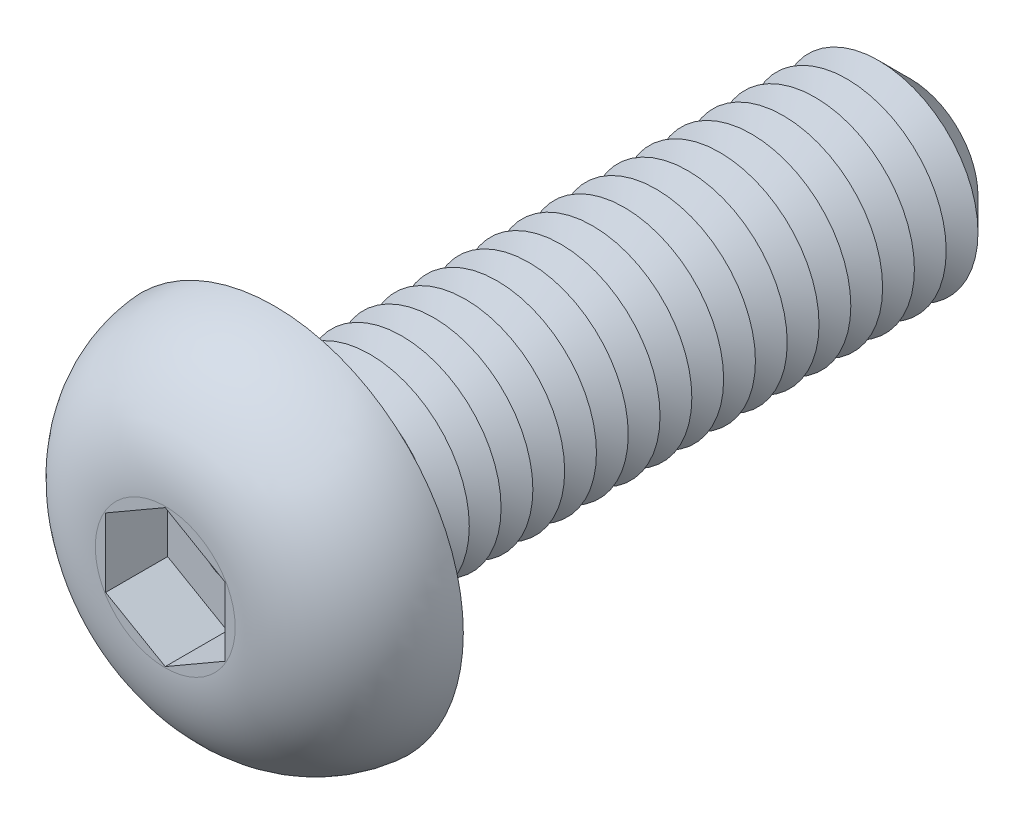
from build123d import *

# Parameters (mm, degrees)
CUT_EXTRUDE1_DEPTH  = 1.56
SKETCH4_R           = 2.5
BOSS_EXTRUDE1_DEPTH = 16
CHAMFER1_SIZE       = 0.8
LPATTERN1_COUNT     = 18
LPATTERN1_PITCH     = 0.8
FILLET2_R           = 0.4
SKETCH6_R           = 0.65
CUT_EXTRUDE2_DEPTH  = 17.19


with BuildPart() as part:
    # Sketch2 → Revolve1 (revolve)
    with BuildSketch(Plane(origin=(0, 0, 0), x_dir=(0, 0, -1), z_dir=(1, 0, 0)), mode=Mode.PRIVATE) as revolve1_sk:
        with BuildLine():
            Line((0, 0), (-2.75, 0))
            Line((-2.75, 0), (-2.75, 1.760434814))
            ThreePointArc((-2.75, 1.760434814), (-1.957940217, 3.791444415), (0, 4.75))
            Line((0, 4.75), (0, 0))
        make_face()
    revolve(revolve1_sk.sketch.rotate(Axis((0, 0, 47.934239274), (0, 0, -1)), 90), axis=Axis((0, 0, 47.934239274), (0, 0, -1)))

    # Sketch3 → Cut-Extrude1 (cut)
    with BuildSketch(Plane.XY.offset(2.75)):
        Polygon((0, 1.732050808), (-1.5, 0.866025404), (-1.5, -0.866025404), (0, -1.732050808), (1.5, -0.866025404), (1.5, 0.866025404), align=None)
    extrude(amount=-CUT_EXTRUDE1_DEPTH, mode=Mode.SUBTRACT)

    # Sketch4 → Boss-Extrude1 (add)
    with BuildSketch(Plane(origin=(0, 0, 0), x_dir=(-1, 0, 0), z_dir=(0, 0, -1))):
        with Locations(Location((0, 0, 0), (0, 0, 180))):
            Circle(SKETCH4_R)
    extrude(amount=BOSS_EXTRUDE1_DEPTH)

    # Chamfer1
    chamfer1_edges = [part.edges().sort_by_distance(p)[0] for p in [
        (-2.5, 0, -16),
    ]]
    chamfer(chamfer1_edges, length=CHAMFER1_SIZE)

    # Sketch5 → Cut-Revolve1 (revolve, cut)
    with BuildSketch(Plane(origin=(0, 0, 0), x_dir=(0, 0, -1), z_dir=(1, 0, 0)), mode=Mode.PRIVATE) as cut_revolve1_sk:
        Polygon((0.8, 2.5), (1.6, 2.5), (1.2, 1.807179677), align=None)
    cut_revolve1 = revolve(cut_revolve1_sk.sketch.rotate(Axis((0, 0, 47.934239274), (0, 0, -1)), 90), axis=Axis((0, 0, 47.934239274), (0, 0, -1)), mode=Mode.SUBTRACT)

    # LPattern1: Cut-Revolve1 ×18
    with Locations(*[(0, 0, -i * LPATTERN1_PITCH) for i in range(1, LPATTERN1_COUNT)]):
        add(cut_revolve1, mode=Mode.SUBTRACT)

    # Fillet2
    fillet2_edges = [part.edges().sort_by_distance(p)[0] for p in [
        (-2.5, 0, 0),
    ]]
    fillet(fillet2_edges, radius=FILLET2_R)

    # Sketch6 → Cut-Extrude2 (cut)
    with BuildSketch(Plane.XY.offset(1.19)):
        Circle(SKETCH6_R)
    extrude(amount=-CUT_EXTRUDE2_DEPTH, mode=Mode.SUBTRACT)


solid = part.part
